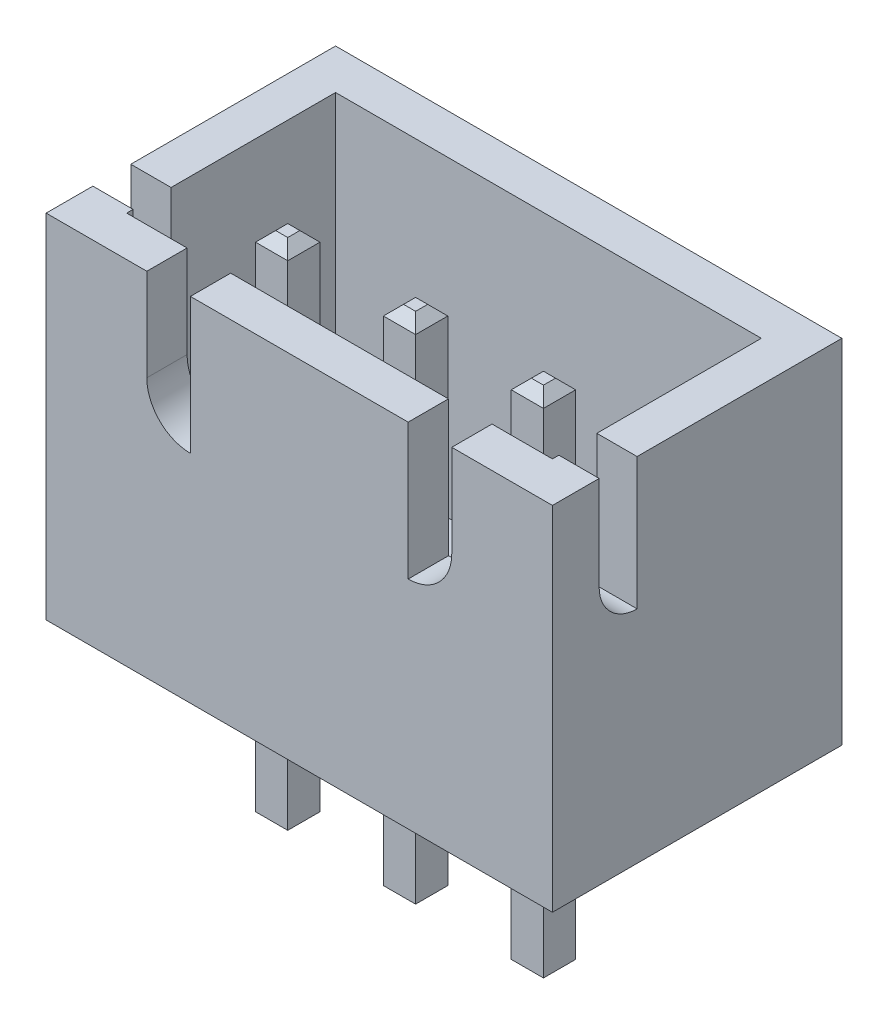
from build123d import *

# Parameters (mm, degrees)
SKETCH1_W                = 10.0584
SKETCH1_H                = 5.75
BOSS_EXTRUDE1_DEPTH      = 7
SHELL1_T                 = -0.8
CUT_EXTRUDE1_DEPTH       = 13.587177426
CUT_EXTRUDE2_REACH       = 12.361
BOSS_EXTRUDE2_DEPTH      = 3.45
BOSS_EXTRUDE2_DEPTH_BACK = 6.75
SKETCH4_W                = 0.64
SKETCH4_H                = 0.64
CHAMFER1_SIZE            = 0.2


with BuildPart() as part:
    # Sketch1 → Boss-Extrude1 (new body)
    with BuildSketch(Plane(origin=(0, 0, 0), x_dir=(1, 0, 0), z_dir=(0, 1, 0))):
        Rectangle(SKETCH1_W, SKETCH1_H)
    extrude(amount=BOSS_EXTRUDE1_DEPTH)

    # Shell1
    shell1_openings = [part.faces().sort_by_distance(p)[0] for p in [
        (0, 7, 0),
    ]]
    offset(amount=SHELL1_T, openings=shell1_openings, kind=Kind.INTERSECTION)

    # Sketch2 → Cut-Extrude1 (cut, through all)
    with BuildSketch(Plane(origin=(5.0292, 0, 0), x_dir=(0, 0, -1), z_dir=(1, 0, 0))):
        with BuildLine():
            Line((-1.19301282, 7), (-1.19301282, 4.379603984))
            ThreePointArc((-1.19301282, 4.379603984), (-1.72610374, 4.600417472), (-1.946917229, 5.133508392))
            Line((-1.946917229, 5.133508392), (-1.946917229, 7))
            Line((-1.946917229, 7), (-1.19301282, 7))
        make_face()
    extrude(amount=-CUT_EXTRUDE1_DEPTH, mode=Mode.SUBTRACT)

    # Sketch3 → Cut-Extrude2 (cut, up to next)
    with BuildSketch(Plane.XY.offset(2.875), mode=Mode.PRIVATE) as cut_extrude2_sk1:
        with BuildLine():
            Line((-3.0292, 7), (-3.0292, 6.728922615))
            Line((-3.0292, 6.728922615), (-3.0292, 5.166308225))
            ThreePointArc((-3.0292, 5.166308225), (-2.775486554, 4.553789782), (-2.16296811, 4.300076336))
            Line((-2.16296811, 4.300076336), (-2.16296811, 7))
            Line((-2.16296811, 7), (-3.0292, 7))
        make_face()
    cut_extrude2_tool1 = extrude(cut_extrude2_sk1.sketch, amount=-CUT_EXTRUDE2_REACH, mode=Mode.PRIVATE) & part.part
    # Sketch3 → Cut-Extrude2 (cut, up to next)
    with BuildSketch(Plane.XY.offset(2.875), mode=Mode.PRIVATE) as cut_extrude2_sk2:
        with BuildLine():
            Line((2.16296811, 7), (3.0292, 7))
            Line((3.0292, 7), (3.0292, 6.728922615))
            Line((3.0292, 6.728922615), (3.0292, 5.166308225))
            ThreePointArc((3.0292, 5.166308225), (2.775486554, 4.553789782), (2.16296811, 4.300076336))
            Line((2.16296811, 4.300076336), (2.16296811, 7))
        make_face()
    cut_extrude2_tool2 = extrude(cut_extrude2_sk2.sketch, amount=-CUT_EXTRUDE2_REACH, mode=Mode.PRIVATE) & part.part
    add(cut_extrude2_tool1.solids().sort_by_distance((-2.578365, 5.735551, 2.875))[0], mode=Mode.SUBTRACT)
    add(cut_extrude2_tool2.solids().sort_by_distance((2.578365, 5.735551, 2.875))[0], mode=Mode.SUBTRACT)

    # Sketch4 → Boss-Extrude2 (add, two sides: drawn at the far end of the back side and taken through both)
    with BuildSketch(Plane.XZ.offset(-BOSS_EXTRUDE2_DEPTH_BACK)):
        with Locations((-2.5792, 0.525)):
            Rectangle(SKETCH4_W, SKETCH4_H)
        with Locations((-0.0392, 0.525)):
            Rectangle(SKETCH4_W, SKETCH4_H)
        with Locations((2.5008, 0.525)):
            Rectangle(SKETCH4_W, SKETCH4_H)
    extrude(amount=BOSS_EXTRUDE2_DEPTH + BOSS_EXTRUDE2_DEPTH_BACK)

    # Chamfer1
    chamfer1_edges = [part.edges().sort_by_distance(p)[0] for p in [
        (-0.0392, 6.75, 0.205),
        (-0.3592, 6.75, 0.525),
        (-0.0392, 6.75, 0.845),
        (0.2808, 6.75, 0.525),
        (-0.0392, -3.45, 0.205),
        (0.2808, -3.45, 0.525),
        (-0.0392, -3.45, 0.845),
        (-0.3592, -3.45, 0.525),
        (2.5008, 6.75, 0.205),
        (2.1808, 6.75, 0.525),
        (2.5008, 6.75, 0.845),
        (2.8208, 6.75, 0.525),
        (2.5008, -3.45, 0.205),
        (2.8208, -3.45, 0.525),
        (2.5008, -3.45, 0.845),
        (2.1808, -3.45, 0.525),
        (-2.2592, 6.75, 0.525),
        (-2.5792, 6.75, 0.205),
        (-2.8992, 6.75, 0.525),
        (-2.5792, 6.75, 0.845),
        (-2.2592, -3.45, 0.525),
        (-2.5792, -3.45, 0.845),
        (-2.8992, -3.45, 0.525),
        (-2.5792, -3.45, 0.205),
    ]]
    chamfer(chamfer1_edges, length=CHAMFER1_SIZE)


solid = part.part
